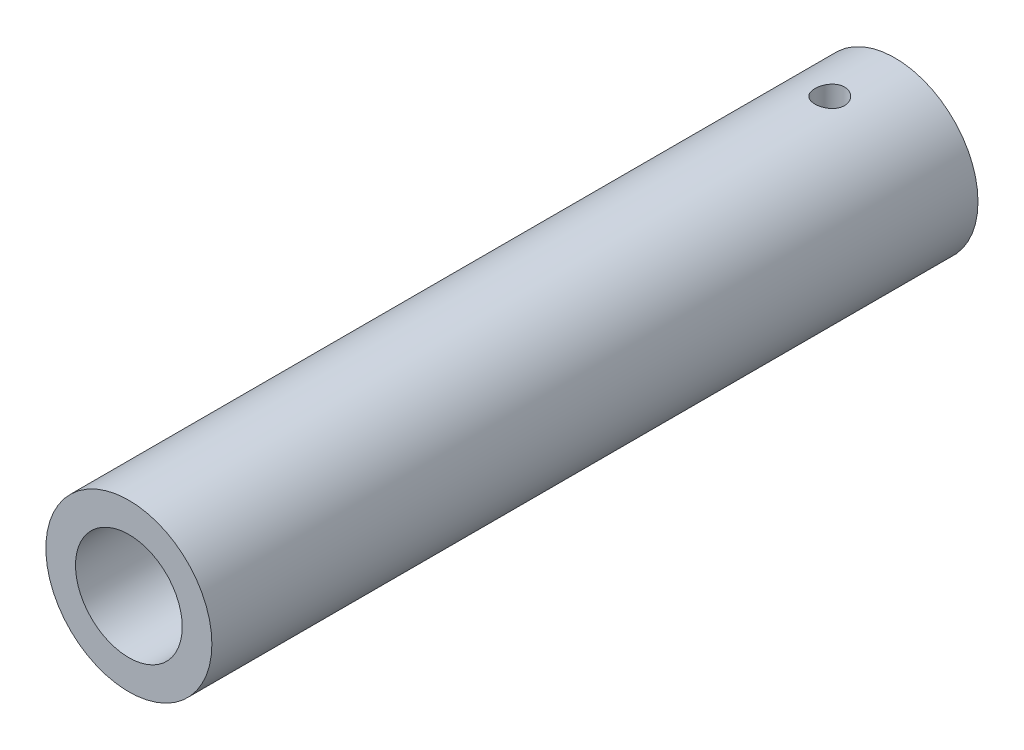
from build123d import *

# Parameters (mm, degrees)
ESQUISSE1_R             = 14
ESQUISSE1_R_2           = 9
EXTRUSION1_DEPTH        = 129.2
ESQUISSE2_R             = 2.5
ENL_V_MAT_EXTRU_1_DEPTH = 15


with BuildPart() as part:
    # Esquisse1 → Extrusion1 (new body)
    with BuildSketch(Plane.XY):
        Circle(ESQUISSE1_R)
        Circle(ESQUISSE1_R_2, mode=Mode.SUBTRACT)
    extrude(amount=EXTRUSION1_DEPTH)

    # Esquisse2 → Enl_v. mat.-Extru.1 (cut, symmetric)
    with BuildSketch(Plane(origin=(0, 0, 0), x_dir=(1, 0, 0), z_dir=(0, 1, 0))):
        with Locations(Location((0, -11, 0), (0, 0, 270))):
            Circle(ESQUISSE2_R)
    extrude(amount=ENL_V_MAT_EXTRU_1_DEPTH, both=True, mode=Mode.SUBTRACT)


solid = part.part
